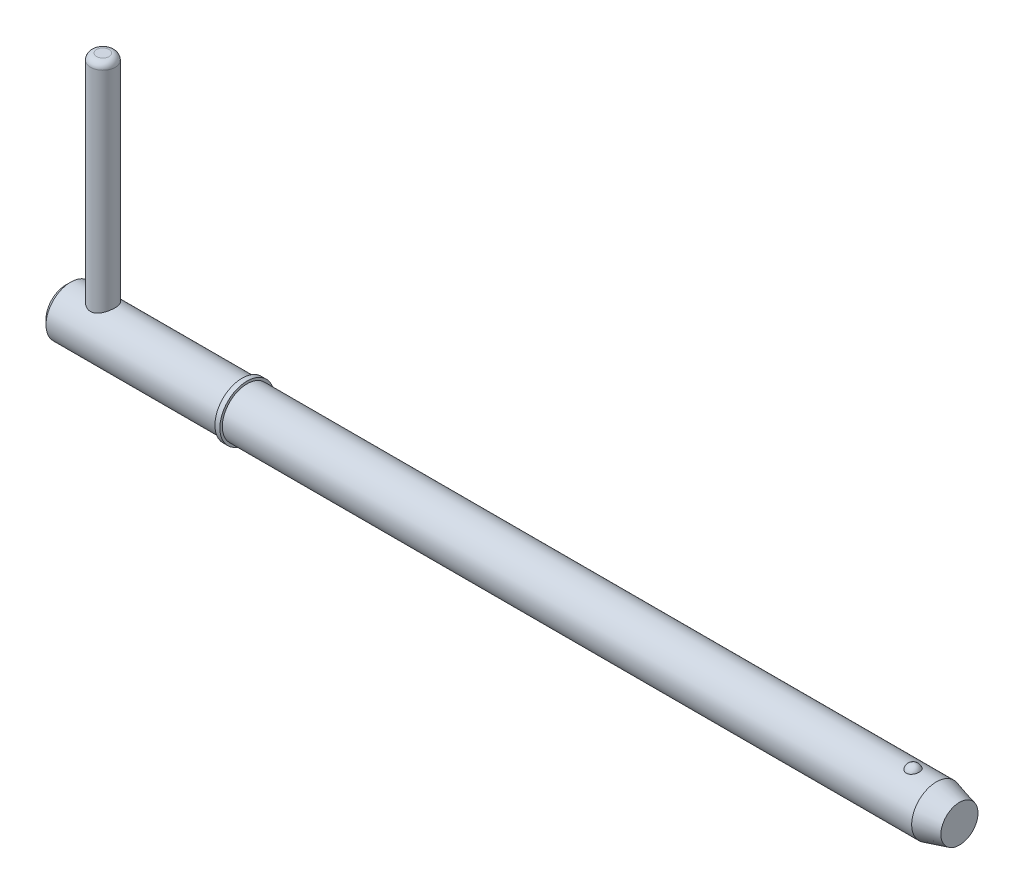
ISO-10303-21;
HEADER;
FILE_DESCRIPTION(('STEP AP214'),'2;1');
FILE_NAME('part.step','',(''),(''),'','','');
FILE_SCHEMA(('AUTOMOTIVE_DESIGN { 1 0 10303 214 1 1 1 1 }'));
ENDSEC;
DATA;
#1=APPLICATION_CONTEXT('core data for automotive mechanical design processes');
#2=APPLICATION_PROTOCOL_DEFINITION('international standard','automotive_design',2000,#1);
#3=PRODUCT_CONTEXT('',#1,'mechanical');
#4=PRODUCT('Part','Part','',(#3));
#5=PRODUCT_RELATED_PRODUCT_CATEGORY('part','',(#4));
#6=PRODUCT_DEFINITION_FORMATION('','',#4);
#7=PRODUCT_DEFINITION_CONTEXT('part definition',#1,'design');
#8=PRODUCT_DEFINITION('design','',#6,#7);
#9=PRODUCT_DEFINITION_SHAPE('','',#8);
#10=(LENGTH_UNIT() NAMED_UNIT(*) SI_UNIT(.MILLI.,.METRE.));
#11=(NAMED_UNIT(*) PLANE_ANGLE_UNIT() SI_UNIT($,.RADIAN.));
#12=(NAMED_UNIT(*) SI_UNIT($,.STERADIAN.) SOLID_ANGLE_UNIT());
#13=UNCERTAINTY_MEASURE_WITH_UNIT(LENGTH_MEASURE(1.E-05),#10,'distance_accuracy_value','');
#14=(GEOMETRIC_REPRESENTATION_CONTEXT(3) GLOBAL_UNCERTAINTY_ASSIGNED_CONTEXT((#13)) GLOBAL_UNIT_ASSIGNED_CONTEXT((#10,
#11,#12)) REPRESENTATION_CONTEXT('',''));
#15=CARTESIAN_POINT('',(0.,0.,0.));
#16=DIRECTION('',(0.,0.,1.));
#17=DIRECTION('',(1.,0.,0.));
#18=AXIS2_PLACEMENT_3D('',#15,#16,#17);
#19=CARTESIAN_POINT('',(3.57,23.02,0.));
#20=DIRECTION('',(0.,-1.,0.));
#21=DIRECTION('',(0.,0.,-1.));
#22=AXIS2_PLACEMENT_3D('',#19,#20,#21);
#23=CYLINDRICAL_SURFACE('',#22,1.19);
#24=CARTESIAN_POINT('',(3.57,-1.785,0.));
#25=DIRECTION('',(0.,1.,0.));
#26=DIRECTION('',(0.,0.,1.));
#27=AXIS2_PLACEMENT_3D('',#24,#25,#26);
#28=CIRCLE('',#27,1.19);
#29=CARTESIAN_POINT('',(3.57,-1.785,1.19));
#30=VERTEX_POINT('',#29);
#31=EDGE_CURVE('P0_E25',#30,#30,#28,.T.);
#32=ORIENTED_EDGE('',*,*,#31,.T.);
#33=EDGE_LOOP('',(#32));
#34=FACE_BOUND('',#33,.T.);
#35=CARTESIAN_POINT('',(3.57,22.425,0.));
#36=DIRECTION('',(0.,1.,0.));
#37=DIRECTION('',(0.,0.,1.));
#38=AXIS2_PLACEMENT_3D('',#35,#36,#37);
#39=CIRCLE('',#38,1.19);
#40=CARTESIAN_POINT('',(3.57,22.425,1.19));
#41=VERTEX_POINT('',#40);
#42=EDGE_CURVE('P0_E29',#41,#41,#39,.F.);
#43=ORIENTED_EDGE('',*,*,#42,.T.);
#44=EDGE_LOOP('',(#43));
#45=FACE_BOUND('',#44,.T.);
#46=ADVANCED_FACE('P0_F14',(#34,#45),#23,.T.);
#47=CARTESIAN_POINT('',(3.57,23.02,0.));
#48=DIRECTION('',(0.,1.,0.));
#49=DIRECTION('',(0.,0.,1.));
#50=AXIS2_PLACEMENT_3D('',#47,#48,#49);
#51=PLANE('',#50);
#52=CARTESIAN_POINT('',(3.57,23.02,0.));
#53=DIRECTION('',(0.,1.,0.));
#54=DIRECTION('',(0.,0.,1.));
#55=AXIS2_PLACEMENT_3D('',#52,#53,#54);
#56=CIRCLE('',#55,0.595);
#57=CARTESIAN_POINT('',(3.57,23.02,0.595));
#58=VERTEX_POINT('',#57);
#59=EDGE_CURVE('P0_E10',#58,#58,#56,.T.);
#60=ORIENTED_EDGE('',*,*,#59,.T.);
#61=EDGE_LOOP('',(#60));
#62=FACE_BOUND('',#61,.T.);
#63=ADVANCED_FACE('P0_F46',(#62),#51,.T.);
#64=CARTESIAN_POINT('',(3.57,-2.38,0.));
#65=DIRECTION('',(0.,1.,0.));
#66=DIRECTION('',(0.,0.,1.));
#67=AXIS2_PLACEMENT_3D('',#64,#65,#66);
#68=PLANE('',#67);
#69=CARTESIAN_POINT('',(3.57,-2.38,0.));
#70=DIRECTION('',(0.,1.,0.));
#71=DIRECTION('',(0.,0.,1.));
#72=AXIS2_PLACEMENT_3D('',#69,#70,#71);
#73=CIRCLE('',#72,0.595);
#74=CARTESIAN_POINT('',(3.57,-2.38,0.595));
#75=VERTEX_POINT('',#74);
#76=EDGE_CURVE('P0_E21',#75,#75,#73,.F.);
#77=ORIENTED_EDGE('',*,*,#76,.T.);
#78=EDGE_LOOP('',(#77));
#79=FACE_BOUND('',#78,.T.);
#80=ADVANCED_FACE('P0_F43',(#79),#68,.F.);
#81=CARTESIAN_POINT('',(3.57,-1.785,0.));
#82=DIRECTION('',(0.,1.,0.));
#83=DIRECTION('',(0.,0.,1.));
#84=AXIS2_PLACEMENT_3D('',#81,#82,#83);
#85=DEGENERATE_TOROIDAL_SURFACE('',#84,0.595,0.595,.T.);
#86=ORIENTED_EDGE('',*,*,#76,.F.);
#87=EDGE_LOOP('',(#86));
#88=FACE_BOUND('',#87,.T.);
#89=ORIENTED_EDGE('',*,*,#31,.F.);
#90=EDGE_LOOP('',(#89));
#91=FACE_BOUND('',#90,.T.);
#92=ADVANCED_FACE('P0_F38',(#88,#91),#85,.T.);
#93=CARTESIAN_POINT('',(3.57,22.425,0.));
#94=DIRECTION('',(0.,1.,0.));
#95=DIRECTION('',(0.,0.,1.));
#96=AXIS2_PLACEMENT_3D('',#93,#94,#95);
#97=DEGENERATE_TOROIDAL_SURFACE('',#96,0.595,0.595,.T.);
#98=ORIENTED_EDGE('',*,*,#42,.F.);
#99=EDGE_LOOP('',(#98));
#100=FACE_BOUND('',#99,.T.);
#101=ORIENTED_EDGE('',*,*,#59,.F.);
#102=EDGE_LOOP('',(#101));
#103=FACE_BOUND('',#102,.T.);
#104=ADVANCED_FACE('P0_F16',(#100,#103),#97,.T.);
#105=CLOSED_SHELL('',(#46,#63,#80,#92,#104));
#106=MANIFOLD_SOLID_BREP('P0_B1',#105);
#107=CARTESIAN_POINT('',(0.,0.,0.));
#108=DIRECTION('',(1.,0.,0.));
#109=DIRECTION('',(0.,0.,-1.));
#110=AXIS2_PLACEMENT_3D('',#107,#108,#109);
#111=CYLINDRICAL_SURFACE('',#110,2.38);
#112=CARTESIAN_POINT('',(83.8094297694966,0.,0.));
#113=DIRECTION('',(1.,0.,0.));
#114=DIRECTION('',(0.,0.,-1.));
#115=AXIS2_PLACEMENT_3D('',#112,#113,#114);
#116=CIRCLE('',#115,2.38);
#117=CARTESIAN_POINT('',(83.8094297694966,0.,-2.38));
#118=VERTEX_POINT('',#117);
#119=EDGE_CURVE('P1_E81',#118,#118,#116,.T.);
#120=ORIENTED_EDGE('',*,*,#119,.F.);
#121=EDGE_LOOP('',(#120));
#122=FACE_BOUND('',#121,.T.);
#123=CARTESIAN_POINT('',(17.45,0.,0.));
#124=DIRECTION('',(1.,0.,0.));
#125=DIRECTION('',(0.,0.,-1.));
#126=AXIS2_PLACEMENT_3D('',#123,#124,#125);
#127=CIRCLE('',#126,2.38);
#128=CARTESIAN_POINT('',(17.45,0.,-2.38));
#129=VERTEX_POINT('',#128);
#130=EDGE_CURVE('P1_E85',#129,#129,#127,.T.);
#131=ORIENTED_EDGE('',*,*,#130,.T.);
#132=EDGE_LOOP('',(#131));
#133=FACE_BOUND('',#132,.T.);
#134=CARTESIAN_POINT('',(81.5634492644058,2.2921568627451,0.640637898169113));
#135=CARTESIAN_POINT('',(81.5303559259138,2.29215737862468,0.64063719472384));
#136=CARTESIAN_POINT('',(81.4972546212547,2.29293179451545,0.637884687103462));
#137=CARTESIAN_POINT('',(81.4320176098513,2.29594030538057,0.626968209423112));
#138=CARTESIAN_POINT('',(81.3998823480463,2.29817506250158,0.618801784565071));
#139=CARTESIAN_POINT('',(81.3375402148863,2.3038430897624,0.597351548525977));
#140=CARTESIAN_POINT('',(81.3073305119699,2.30727454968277,0.584075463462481));
#141=CARTESIAN_POINT('',(81.2495674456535,2.31495941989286,0.552829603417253));
#142=CARTESIAN_POINT('',(81.2220141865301,2.31921286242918,0.534859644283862));
#143=CARTESIAN_POINT('',(81.1695938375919,2.32820213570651,0.494282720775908));
#144=CARTESIAN_POINT('',(81.1448050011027,2.33294694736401,0.471576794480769));
#145=CARTESIAN_POINT('',(81.0992169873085,2.34234144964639,0.422446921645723));
#146=CARTESIAN_POINT('',(81.0784185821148,2.34699112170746,0.396022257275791));
#147=CARTESIAN_POINT('',(81.0403580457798,2.35593942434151,0.33885587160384));
#148=CARTESIAN_POINT('',(81.0233051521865,2.36021170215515,0.307970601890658));
#149=CARTESIAN_POINT('',(80.9943607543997,2.3677057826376,0.243750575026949));
#150=CARTESIAN_POINT('',(80.9824701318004,2.37092740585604,0.210415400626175));
#151=CARTESIAN_POINT('',(80.9638076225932,2.37606901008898,0.141189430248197));
#152=CARTESIAN_POINT('',(80.9571956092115,2.37794816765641,0.105252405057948));
#153=CARTESIAN_POINT('',(80.9498095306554,2.38005135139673,0.0327351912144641));
#154=CARTESIAN_POINT('',(80.9490358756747,2.38027526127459,-0.00384504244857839));
#155=CARTESIAN_POINT('',(80.9533628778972,2.37903842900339,-0.0769838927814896));
#156=CARTESIAN_POINT('',(80.9585202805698,2.37756141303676,-0.113538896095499));
#157=CARTESIAN_POINT('',(80.9747013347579,2.37305303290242,-0.185229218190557));
#158=CARTESIAN_POINT('',(80.9857251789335,2.37002161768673,-0.220364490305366));
#159=CARTESIAN_POINT('',(81.0133977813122,2.36273722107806,-0.288156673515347));
#160=CARTESIAN_POINT('',(81.0300389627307,2.35848588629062,-0.320816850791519));
#161=CARTESIAN_POINT('',(81.0685984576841,2.34923130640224,-0.382744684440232));
#162=CARTESIAN_POINT('',(81.090516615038,2.34422808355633,-0.412012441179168));
#163=CARTESIAN_POINT('',(81.1387549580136,2.33412555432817,-0.465830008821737));
#164=CARTESIAN_POINT('',(81.1650028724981,2.32902887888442,-0.490444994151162));
#165=CARTESIAN_POINT('',(81.2214769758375,2.31926941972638,-0.534700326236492));
#166=CARTESIAN_POINT('',(81.251702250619,2.3146065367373,-0.554341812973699));
#167=CARTESIAN_POINT('',(81.3140618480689,2.30645675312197,-0.587312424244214));
#168=CARTESIAN_POINT('',(81.3460780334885,2.30293152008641,-0.600855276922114));
#169=CARTESIAN_POINT('',(81.4120795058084,2.29725171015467,-0.622220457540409));
#170=CARTESIAN_POINT('',(81.4460641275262,2.29509667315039,-0.630044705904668));
#171=CARTESIAN_POINT('',(81.513299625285,2.29249264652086,-0.639452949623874));
#172=CARTESIAN_POINT('',(81.5465087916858,2.29196755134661,-0.641315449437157));
#173=CARTESIAN_POINT('',(81.612763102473,2.29246849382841,-0.639522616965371));
#174=CARTESIAN_POINT('',(81.6458082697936,2.29349430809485,-0.635868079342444));
#175=CARTESIAN_POINT('',(81.7101025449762,2.29694059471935,-0.623301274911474));
#176=CARTESIAN_POINT('',(81.7413744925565,2.29933234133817,-0.614497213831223));
#177=CARTESIAN_POINT('',(81.8019952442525,2.30522511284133,-0.592006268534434));
#178=CARTESIAN_POINT('',(81.8313438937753,2.30872622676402,-0.578318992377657));
#179=CARTESIAN_POINT('',(81.8880369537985,2.31655795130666,-0.546112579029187));
#180=CARTESIAN_POINT('',(81.915320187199,2.32090569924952,-0.527490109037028));
#181=CARTESIAN_POINT('',(81.9664904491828,2.3299220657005,-0.486117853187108));
#182=CARTESIAN_POINT('',(81.9903767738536,2.33459075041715,-0.463367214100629));
#183=CARTESIAN_POINT('',(82.0352722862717,2.34399834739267,-0.413220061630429));
#184=CARTESIAN_POINT('',(82.0560972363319,2.34873051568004,-0.38565730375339));
#185=CARTESIAN_POINT('',(82.093056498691,2.35754932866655,-0.327455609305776));
#186=CARTESIAN_POINT('',(82.1091898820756,2.36163584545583,-0.296816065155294));
#187=CARTESIAN_POINT('',(82.1369822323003,2.36889321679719,-0.232047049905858));
#188=CARTESIAN_POINT('',(82.1484450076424,2.37202275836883,-0.19782862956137));
#189=CARTESIAN_POINT('',(82.1657523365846,2.37681926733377,-0.127900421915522));
#190=CARTESIAN_POINT('',(82.1715962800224,2.37848607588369,-0.0921904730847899));
#191=CARTESIAN_POINT('',(82.177605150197,2.38020024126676,-0.0196348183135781));
#192=CARTESIAN_POINT('',(82.1776704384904,2.38021918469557,0.0172198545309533));
#193=CARTESIAN_POINT('',(82.1718689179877,2.37856356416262,0.0904219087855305));
#194=CARTESIAN_POINT('',(82.1660018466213,2.37688892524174,0.126769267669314));
#195=CARTESIAN_POINT('',(82.148425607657,2.37201688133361,0.198028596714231));
#196=CARTESIAN_POINT('',(82.1366998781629,2.36881516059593,0.232936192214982));
#197=CARTESIAN_POINT('',(82.1076354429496,2.36123444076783,0.30019678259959));
#198=CARTESIAN_POINT('',(82.0902967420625,2.3568554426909,0.332549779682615));
#199=CARTESIAN_POINT('',(82.0505350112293,2.34744667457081,0.393495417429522));
#200=CARTESIAN_POINT('',(82.0281528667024,2.34242227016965,0.422115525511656));
#201=CARTESIAN_POINT('',(81.9787391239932,2.33227293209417,0.475004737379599));
#202=CARTESIAN_POINT('',(81.9517076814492,2.32714800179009,0.49927398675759));
#203=CARTESIAN_POINT('',(81.8944988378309,2.31755359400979,0.542046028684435));
#204=CARTESIAN_POINT('',(81.8644297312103,2.3130698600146,0.560690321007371));
#205=CARTESIAN_POINT('',(81.8013869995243,2.30514125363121,0.592447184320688));
#206=CARTESIAN_POINT('',(81.7684158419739,2.30169550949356,0.605564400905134));
#207=CARTESIAN_POINT('',(81.7068424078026,2.29677744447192,0.623927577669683));
#208=CARTESIAN_POINT('',(81.6785555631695,2.295058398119,0.630178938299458));
#209=CARTESIAN_POINT('',(81.6213308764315,2.29274795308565,0.638534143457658));
#210=CARTESIAN_POINT('',(81.5923931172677,2.29215641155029,0.640638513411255));
#211=CARTESIAN_POINT('',(81.5634492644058,2.2921568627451,0.640637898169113));
#212=B_SPLINE_CURVE_WITH_KNOTS('',3,(#134,#135,#136,#137,#138,#139,#140,#141,#142,#143,#144,
#145,#146,#147,#148,#149,#150,#151,#152,#153,#154,#155,#156,#157,#158,#159,#160,#161,#162,#163,
#164,#165,#166,#167,#168,#169,#170,#171,#172,#173,#174,#175,#176,#177,#178,#179,#180,#181,#182,
#183,#184,#185,#186,#187,#188,#189,#190,#191,#192,#193,#194,#195,#196,#197,#198,#199,#200,#201,
#202,#203,#204,#205,#206,#207,#208,#209,#210,#211),.UNSPECIFIED.,.T.,.F.,(4,2,2,2,2,2,2,2,2,2,2,
2,2,2,2,2,2,2,2,2,2,2,2,2,2,2,2,2,2,2,2,2,2,2,2,2,2,2,4),(0.,0.0991724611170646,
0.198389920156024,0.297457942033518,0.396529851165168,0.497927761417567,0.599345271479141,
0.70547553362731,0.811623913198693,0.920876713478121,1.03013718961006,1.14045177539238,
1.25076998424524,1.36093998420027,1.47110672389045,1.57959248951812,1.68805336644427,
1.79234266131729,1.89659691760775,1.99590391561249,2.09519661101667,2.19247425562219,
2.2897597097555,2.38926978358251,2.48880044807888,2.59293588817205,2.69709193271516,
2.80525821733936,2.91343624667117,3.0234791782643,3.13352698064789,3.24388765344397,
3.35424823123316,3.46374443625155,3.5732369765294,3.67968690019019,3.78604717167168,
3.87279565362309,3.9595331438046),.UNSPECIFIED.);
#213=CARTESIAN_POINT('',(81.5634492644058,2.2921568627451,0.640637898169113));
#214=VERTEX_POINT('',#213);
#215=EDGE_CURVE('P1_E35',#214,#214,#212,.T.);
#216=ORIENTED_EDGE('',*,*,#215,.T.);
#217=EDGE_LOOP('',(#216));
#218=FACE_BOUND('',#217,.T.);
#219=ADVANCED_FACE('P1_F13',(#122,#133,#218),#111,.T.);
#220=CARTESIAN_POINT('',(0.,0.,0.));
#221=DIRECTION('',(-1.,0.,0.));
#222=DIRECTION('',(0.,0.,1.));
#223=AXIS2_PLACEMENT_3D('',#220,#221,#222);
#224=PLANE('',#223);
#225=CARTESIAN_POINT('',(0.,0.,0.));
#226=DIRECTION('',(1.,0.,0.));
#227=DIRECTION('',(0.,0.,-1.));
#228=AXIS2_PLACEMENT_3D('',#225,#226,#227);
#229=CIRCLE('',#228,1.904);
#230=CARTESIAN_POINT('',(0.,0.,-1.904));
#231=VERTEX_POINT('',#230);
#232=EDGE_CURVE('P1_E9',#231,#231,#229,.T.);
#233=ORIENTED_EDGE('',*,*,#232,.F.);
#234=EDGE_LOOP('',(#233));
#235=FACE_BOUND('',#234,.T.);
#236=ADVANCED_FACE('P1_F15',(#235),#224,.T.);
#237=CARTESIAN_POINT('',(0.475999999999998,0.,0.));
#238=DIRECTION('',(1.,0.,0.));
#239=DIRECTION('',(0.,0.,-1.));
#240=AXIS2_PLACEMENT_3D('',#237,#238,#239);
#241=CONICAL_SURFACE('',#240,2.38,0.78539816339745);
#242=ORIENTED_EDGE('',*,*,#232,.T.);
#243=EDGE_LOOP('',(#242));
#244=FACE_BOUND('',#243,.T.);
#245=CARTESIAN_POINT('',(0.475999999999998,0.,0.));
#246=DIRECTION('',(1.,0.,0.));
#247=DIRECTION('',(0.,0.,-1.));
#248=AXIS2_PLACEMENT_3D('',#245,#246,#247);
#249=CIRCLE('',#248,2.38);
#250=CARTESIAN_POINT('',(0.475999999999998,0.,-2.38));
#251=VERTEX_POINT('',#250);
#252=EDGE_CURVE('P1_E26',#251,#251,#249,.T.);
#253=ORIENTED_EDGE('',*,*,#252,.F.);
#254=EDGE_LOOP('',(#253));
#255=FACE_BOUND('',#254,.T.);
#256=ADVANCED_FACE('P1_F77',(#244,#255),#241,.T.);
#257=CARTESIAN_POINT('',(0.,0.,0.));
#258=DIRECTION('',(1.,0.,0.));
#259=DIRECTION('',(0.,0.,-1.));
#260=AXIS2_PLACEMENT_3D('',#257,#258,#259);
#261=CYLINDRICAL_SURFACE('',#260,2.38);
#262=CARTESIAN_POINT('',(3.57,-2.06114046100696,1.19));
#263=CARTESIAN_POINT('',(3.50799170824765,-2.06114586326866,1.18999567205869));
#264=CARTESIAN_POINT('',(3.4459051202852,-2.0639812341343,1.18512096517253));
#265=CARTESIAN_POINT('',(3.32363755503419,-2.07491216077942,1.16587061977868));
#266=CARTESIAN_POINT('',(3.26346086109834,-2.08301876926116,1.15147501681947));
#267=CARTESIAN_POINT('',(3.14701251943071,-2.10331722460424,1.11395893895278));
#268=CARTESIAN_POINT('',(3.09072196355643,-2.1154873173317,1.09088484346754));
#269=CARTESIAN_POINT('',(2.9828251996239,-2.14250771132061,1.03680835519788));
#270=CARTESIAN_POINT('',(2.93121924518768,-2.15735815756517,1.00580553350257));
#271=CARTESIAN_POINT('',(2.82945618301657,-2.18956274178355,0.933753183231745));
#272=CARTESIAN_POINT('',(2.77976962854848,-2.20702235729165,0.892085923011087));
#273=CARTESIAN_POINT('',(2.68772401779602,-2.2416265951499,0.801172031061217));
#274=CARTESIAN_POINT('',(2.64536861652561,-2.25877105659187,0.751921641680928));
#275=CARTESIAN_POINT('',(2.56639309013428,-2.29219557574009,0.64318258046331));
#276=CARTESIAN_POINT('',(2.53035201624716,-2.30833946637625,0.583227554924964));
#277=CARTESIAN_POINT('',(2.46908238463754,-2.3365739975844,0.45714686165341));
#278=CARTESIAN_POINT('',(2.44384700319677,-2.34866719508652,0.391025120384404));
#279=CARTESIAN_POINT('',(2.40676945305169,-2.36667748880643,0.259473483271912));
#280=CARTESIAN_POINT('',(2.39410206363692,-2.37297281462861,0.194329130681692));
#281=CARTESIAN_POINT('',(2.3798023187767,-2.3800902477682,0.0625590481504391));
#282=CARTESIAN_POINT('',(2.37816328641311,-2.38091566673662,-0.00406576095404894));
#283=CARTESIAN_POINT('',(2.38564854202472,-2.37717948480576,-0.130700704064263));
#284=CARTESIAN_POINT('',(2.39384923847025,-2.37308010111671,-0.190782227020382));
#285=CARTESIAN_POINT('',(2.41912820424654,-2.360653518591,-0.308583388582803));
#286=CARTESIAN_POINT('',(2.43620713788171,-2.35232600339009,-0.366302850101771));
#287=CARTESIAN_POINT('',(2.47886825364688,-2.33206184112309,-0.478748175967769));
#288=CARTESIAN_POINT('',(2.50456481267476,-2.32007685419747,-0.533421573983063));
#289=CARTESIAN_POINT('',(2.56357346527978,-2.29357798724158,-0.637812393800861));
#290=CARTESIAN_POINT('',(2.5968882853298,-2.27906320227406,-0.687528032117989));
#291=CARTESIAN_POINT('',(2.67380546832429,-2.24724829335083,-0.785606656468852));
#292=CARTESIAN_POINT('',(2.71808260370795,-2.22981457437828,-0.833397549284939));
#293=CARTESIAN_POINT('',(2.81386177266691,-2.19500665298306,-0.921184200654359));
#294=CARTESIAN_POINT('',(2.86536931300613,-2.17763250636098,-0.961173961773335));
#295=CARTESIAN_POINT('',(2.97815134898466,-2.14371545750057,-1.03471134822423));
#296=CARTESIAN_POINT('',(3.03983836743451,-2.12729540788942,-1.06768860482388));
#297=CARTESIAN_POINT('',(3.16889582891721,-2.09886785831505,-1.12254974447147));
#298=CARTESIAN_POINT('',(3.2362602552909,-2.0868557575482,-1.14444520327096));
#299=CARTESIAN_POINT('',(3.36914526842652,-2.06994116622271,-1.1747444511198));
#300=CARTESIAN_POINT('',(3.43438893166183,-2.06455070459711,-1.18407989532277));
#301=CARTESIAN_POINT('',(3.56571759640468,-2.06010324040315,-1.1918051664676));
#302=CARTESIAN_POINT('',(3.63180197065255,-2.06104176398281,-1.19020272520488));
#303=CARTESIAN_POINT('',(3.75522816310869,-2.06862860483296,-1.17695289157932));
#304=CARTESIAN_POINT('',(3.81273554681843,-2.07464109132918,-1.16642350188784));
#305=CARTESIAN_POINT('',(3.92505766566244,-2.09075885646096,-1.1372785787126));
#306=CARTESIAN_POINT('',(3.97987152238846,-2.1008654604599,-1.1186604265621));
#307=CARTESIAN_POINT('',(4.08813948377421,-2.12458104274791,-1.07296063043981));
#308=CARTESIAN_POINT('',(4.14141303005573,-2.13833055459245,-1.04552693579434));
#309=CARTESIAN_POINT('',(4.2429084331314,-2.16765782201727,-0.983281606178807));
#310=CARTESIAN_POINT('',(4.29112767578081,-2.18323651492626,-0.948466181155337));
#311=CARTESIAN_POINT('',(4.38750473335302,-2.2168271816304,-0.867316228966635));
#312=CARTESIAN_POINT('',(4.43488860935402,-2.23489833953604,-0.82008287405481));
#313=CARTESIAN_POINT('',(4.52130056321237,-2.26973739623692,-0.718051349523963));
#314=CARTESIAN_POINT('',(4.56032581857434,-2.28650485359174,-0.663250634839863));
#315=CARTESIAN_POINT('',(4.62978273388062,-2.31742220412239,-0.545657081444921));
#316=CARTESIAN_POINT('',(4.65996041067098,-2.33149133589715,-0.482691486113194));
#317=CARTESIAN_POINT('',(4.7089941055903,-2.35481192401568,-0.351671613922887));
#318=CARTESIAN_POINT('',(4.7278600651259,-2.36406760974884,-0.283621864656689));
#319=CARTESIAN_POINT('',(4.75210859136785,-2.3760433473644,-0.151105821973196));
#320=CARTESIAN_POINT('',(4.75856947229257,-2.37928514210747,-0.0868836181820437));
#321=CARTESIAN_POINT('',(4.76100348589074,-2.38050135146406,0.0417999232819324));
#322=CARTESIAN_POINT('',(4.75698028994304,-2.37847760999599,0.106261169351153));
#323=CARTESIAN_POINT('',(4.73927447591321,-2.36969422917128,0.229120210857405));
#324=CARTESIAN_POINT('',(4.72624582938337,-2.36325544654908,0.287637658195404));
#325=CARTESIAN_POINT('',(4.69178087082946,-2.34658591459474,0.401560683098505));
#326=CARTESIAN_POINT('',(4.67034335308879,-2.33635462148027,0.456965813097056));
#327=CARTESIAN_POINT('',(4.61871480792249,-2.31247857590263,0.565753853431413));
#328=CARTESIAN_POINT('',(4.58818860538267,-2.29870654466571,0.618948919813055));
#329=CARTESIAN_POINT('',(4.51967006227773,-2.26918878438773,0.719681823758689));
#330=CARTESIAN_POINT('',(4.48167429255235,-2.25344215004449,0.76721704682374));
#331=CARTESIAN_POINT('',(4.39491140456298,-2.21969046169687,0.860267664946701));
#332=CARTESIAN_POINT('',(4.34544863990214,-2.20161660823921,0.905111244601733));
#333=CARTESIAN_POINT('',(4.23943364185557,-2.16655060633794,0.986109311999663));
#334=CARTESIAN_POINT('',(4.18287520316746,-2.1495594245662,1.02225611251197));
#335=CARTESIAN_POINT('',(4.06190239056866,-2.1181953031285,1.08579298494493));
#336=CARTESIAN_POINT('',(3.9972962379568,-2.10392207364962,1.11287022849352));
#337=CARTESIAN_POINT('',(3.86353443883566,-2.08090726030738,1.15534566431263));
#338=CARTESIAN_POINT('',(3.7943948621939,-2.07214719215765,1.17078291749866));
#339=CARTESIAN_POINT('',(3.69875162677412,-2.06499834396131,1.18329673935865));
#340=CARTESIAN_POINT('',(3.67309220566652,-2.06355673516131,1.18580656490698));
#341=CARTESIAN_POINT('',(3.62162638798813,-2.06162663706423,1.18915915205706));
#342=CARTESIAN_POINT('',(3.59581998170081,-2.0611382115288,1.19000180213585));
#343=CARTESIAN_POINT('',(3.57,-2.06114046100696,1.19));
#344=B_SPLINE_CURVE_WITH_KNOTS('',3,(#262,#263,#264,#265,#266,#267,#268,#269,#270,#271,#272,
#273,#274,#275,#276,#277,#278,#279,#280,#281,#282,#283,#284,#285,#286,#287,#288,#289,#290,#291,
#292,#293,#294,#295,#296,#297,#298,#299,#300,#301,#302,#303,#304,#305,#306,#307,#308,#309,#310,
#311,#312,#313,#314,#315,#316,#317,#318,#319,#320,#321,#322,#323,#324,#325,#326,#327,#328,#329,
#330,#331,#332,#333,#334,#335,#336,#337,#338,#339,#340,#341,#342,#343),.UNSPECIFIED.,.T.,.F.,(4,
2,2,2,2,2,2,2,2,2,2,2,2,2,2,2,2,2,2,2,2,2,2,2,2,2,2,2,2,2,2,2,2,2,2,2,2,2,2,2,4),(0.,
0.185916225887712,0.372223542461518,0.557549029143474,0.742884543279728,0.943506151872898,
1.14422749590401,1.35847891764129,1.5725948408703,1.77147547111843,1.97023568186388,
2.15171156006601,2.33320101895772,2.51720146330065,2.70126786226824,2.902733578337,
3.10435357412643,3.31877721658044,3.53297641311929,3.73020126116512,3.92728670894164,
4.1028127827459,4.27839572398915,4.46211082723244,4.64592048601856,4.8529002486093,
5.0599497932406,5.27246375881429,5.48479067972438,5.67763601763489,5.87041383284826,
6.05048865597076,6.23058930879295,6.41839293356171,6.60628297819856,6.8128718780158,
7.01964271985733,7.2329479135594,7.44553408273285,7.52294360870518,7.60035831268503),.UNSPECIFIED.);
#345=CARTESIAN_POINT('',(3.57,-2.06114046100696,1.19));
#346=VERTEX_POINT('',#345);
#347=EDGE_CURVE('P1_E17',#346,#346,#344,.T.);
#348=ORIENTED_EDGE('',*,*,#347,.F.);
#349=EDGE_LOOP('',(#348));
#350=FACE_BOUND('',#349,.T.);
#351=CARTESIAN_POINT('',(3.57,2.06114046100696,1.19));
#352=CARTESIAN_POINT('',(3.63200829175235,2.06114586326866,1.18999567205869));
#353=CARTESIAN_POINT('',(3.6940948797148,2.0639812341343,1.18512096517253));
#354=CARTESIAN_POINT('',(3.81636244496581,2.07491216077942,1.16587061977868));
#355=CARTESIAN_POINT('',(3.87653913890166,2.08301876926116,1.15147501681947));
#356=CARTESIAN_POINT('',(3.99298748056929,2.10331722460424,1.11395893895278));
#357=CARTESIAN_POINT('',(4.04927803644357,2.1154873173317,1.09088484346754));
#358=CARTESIAN_POINT('',(4.1571748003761,2.14250771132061,1.03680835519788));
#359=CARTESIAN_POINT('',(4.20878075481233,2.15735815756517,1.00580553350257));
#360=CARTESIAN_POINT('',(4.31054381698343,2.18956274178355,0.933753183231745));
#361=CARTESIAN_POINT('',(4.36023037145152,2.20702235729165,0.892085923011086));
#362=CARTESIAN_POINT('',(4.45227598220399,2.2416265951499,0.801172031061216));
#363=CARTESIAN_POINT('',(4.49463138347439,2.25877105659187,0.751921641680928));
#364=CARTESIAN_POINT('',(4.57360690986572,2.29219557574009,0.643182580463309));
#365=CARTESIAN_POINT('',(4.60964798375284,2.30833946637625,0.583227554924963));
#366=CARTESIAN_POINT('',(4.67091761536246,2.3365739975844,0.457146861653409));
#367=CARTESIAN_POINT('',(4.69615299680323,2.34866719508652,0.391025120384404));
#368=CARTESIAN_POINT('',(4.73323054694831,2.36667748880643,0.259473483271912));
#369=CARTESIAN_POINT('',(4.74589793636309,2.37297281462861,0.194329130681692));
#370=CARTESIAN_POINT('',(4.7601976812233,2.3800902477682,0.0625590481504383));
#371=CARTESIAN_POINT('',(4.76183671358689,2.38091566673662,-0.00406576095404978));
#372=CARTESIAN_POINT('',(4.75435145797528,2.37717948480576,-0.130700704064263));
#373=CARTESIAN_POINT('',(4.74615076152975,2.37308010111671,-0.190782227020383));
#374=CARTESIAN_POINT('',(4.72087179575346,2.360653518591,-0.308583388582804));
#375=CARTESIAN_POINT('',(4.70379286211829,2.35232600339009,-0.366302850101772));
#376=CARTESIAN_POINT('',(4.66113174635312,2.33206184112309,-0.478748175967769));
#377=CARTESIAN_POINT('',(4.63543518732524,2.32007685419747,-0.533421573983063));
#378=CARTESIAN_POINT('',(4.57642653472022,2.29357798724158,-0.637812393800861));
#379=CARTESIAN_POINT('',(4.5431117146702,2.27906320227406,-0.687528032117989));
#380=CARTESIAN_POINT('',(4.46619453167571,2.24724829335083,-0.785606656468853));
#381=CARTESIAN_POINT('',(4.42191739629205,2.22981457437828,-0.83339754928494));
#382=CARTESIAN_POINT('',(4.32613822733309,2.19500665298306,-0.921184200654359));
#383=CARTESIAN_POINT('',(4.27463068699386,2.17763250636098,-0.961173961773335));
#384=CARTESIAN_POINT('',(4.16184865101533,2.14371545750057,-1.03471134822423));
#385=CARTESIAN_POINT('',(4.10016163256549,2.12729540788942,-1.06768860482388));
#386=CARTESIAN_POINT('',(3.97110417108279,2.09886785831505,-1.12254974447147));
#387=CARTESIAN_POINT('',(3.9037397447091,2.0868557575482,-1.14444520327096));
#388=CARTESIAN_POINT('',(3.77085473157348,2.06994116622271,-1.1747444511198));
#389=CARTESIAN_POINT('',(3.70561106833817,2.06455070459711,-1.18407989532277));
#390=CARTESIAN_POINT('',(3.57428240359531,2.06010324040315,-1.1918051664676));
#391=CARTESIAN_POINT('',(3.50819802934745,2.06104176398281,-1.19020272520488));
#392=CARTESIAN_POINT('',(3.38477183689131,2.06862860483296,-1.17695289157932));
#393=CARTESIAN_POINT('',(3.32726445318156,2.07464109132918,-1.16642350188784));
#394=CARTESIAN_POINT('',(3.21494233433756,2.09075885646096,-1.1372785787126));
#395=CARTESIAN_POINT('',(3.16012847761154,2.1008654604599,-1.1186604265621));
#396=CARTESIAN_POINT('',(3.05186051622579,2.12458104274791,-1.07296063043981));
#397=CARTESIAN_POINT('',(2.99858696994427,2.13833055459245,-1.04552693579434));
#398=CARTESIAN_POINT('',(2.8970915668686,2.16765782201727,-0.983281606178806));
#399=CARTESIAN_POINT('',(2.84887232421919,2.18323651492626,-0.948466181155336));
#400=CARTESIAN_POINT('',(2.75249526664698,2.2168271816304,-0.867316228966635));
#401=CARTESIAN_POINT('',(2.70511139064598,2.23489833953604,-0.820082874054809));
#402=CARTESIAN_POINT('',(2.61869943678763,2.26973739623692,-0.718051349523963));
#403=CARTESIAN_POINT('',(2.57967418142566,2.28650485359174,-0.663250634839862));
#404=CARTESIAN_POINT('',(2.51021726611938,2.31742220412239,-0.54565708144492));
#405=CARTESIAN_POINT('',(2.48003958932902,2.33149133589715,-0.482691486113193));
#406=CARTESIAN_POINT('',(2.4310058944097,2.35481192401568,-0.351671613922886));
#407=CARTESIAN_POINT('',(2.4121399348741,2.36406760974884,-0.283621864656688));
#408=CARTESIAN_POINT('',(2.38789140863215,2.3760433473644,-0.151105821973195));
#409=CARTESIAN_POINT('',(2.38143052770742,2.37928514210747,-0.0868836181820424));
#410=CARTESIAN_POINT('',(2.37899651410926,2.38050135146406,0.0417999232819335));
#411=CARTESIAN_POINT('',(2.38301971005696,2.37847760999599,0.106261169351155));
#412=CARTESIAN_POINT('',(2.40072552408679,2.36969422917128,0.229120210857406));
#413=CARTESIAN_POINT('',(2.41375417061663,2.36325544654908,0.287637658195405));
#414=CARTESIAN_POINT('',(2.44821912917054,2.34658591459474,0.401560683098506));
#415=CARTESIAN_POINT('',(2.46965664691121,2.33635462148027,0.456965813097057));
#416=CARTESIAN_POINT('',(2.52128519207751,2.31247857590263,0.565753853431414));
#417=CARTESIAN_POINT('',(2.55181139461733,2.29870654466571,0.618948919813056));
#418=CARTESIAN_POINT('',(2.62032993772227,2.26918878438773,0.719681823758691));
#419=CARTESIAN_POINT('',(2.65832570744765,2.25344215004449,0.767217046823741));
#420=CARTESIAN_POINT('',(2.74508859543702,2.21969046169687,0.860267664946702));
#421=CARTESIAN_POINT('',(2.79455136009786,2.20161660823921,0.905111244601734));
#422=CARTESIAN_POINT('',(2.90056635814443,2.16655060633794,0.986109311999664));
#423=CARTESIAN_POINT('',(2.95712479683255,2.1495594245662,1.02225611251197));
#424=CARTESIAN_POINT('',(3.07809760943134,2.1181953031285,1.08579298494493));
#425=CARTESIAN_POINT('',(3.1427037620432,2.10392207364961,1.11287022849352));
#426=CARTESIAN_POINT('',(3.27646556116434,2.08090726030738,1.15534566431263));
#427=CARTESIAN_POINT('',(3.3456051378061,2.07214719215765,1.17078291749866));
#428=CARTESIAN_POINT('',(3.44124837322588,2.06499834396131,1.18329673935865));
#429=CARTESIAN_POINT('',(3.46690779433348,2.06355673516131,1.18580656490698));
#430=CARTESIAN_POINT('',(3.51837361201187,2.06162663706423,1.18915915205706));
#431=CARTESIAN_POINT('',(3.54418001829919,2.0611382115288,1.19000180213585));
#432=CARTESIAN_POINT('',(3.57,2.06114046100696,1.19));
#433=B_SPLINE_CURVE_WITH_KNOTS('',3,(#351,#352,#353,#354,#355,#356,#357,#358,#359,#360,#361,
#362,#363,#364,#365,#366,#367,#368,#369,#370,#371,#372,#373,#374,#375,#376,#377,#378,#379,#380,
#381,#382,#383,#384,#385,#386,#387,#388,#389,#390,#391,#392,#393,#394,#395,#396,#397,#398,#399,
#400,#401,#402,#403,#404,#405,#406,#407,#408,#409,#410,#411,#412,#413,#414,#415,#416,#417,#418,
#419,#420,#421,#422,#423,#424,#425,#426,#427,#428,#429,#430,#431,#432),.UNSPECIFIED.,.T.,.F.,(4,
2,2,2,2,2,2,2,2,2,2,2,2,2,2,2,2,2,2,2,2,2,2,2,2,2,2,2,2,2,2,2,2,2,2,2,2,2,2,2,4),(0.,
0.185916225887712,0.372223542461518,0.557549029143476,0.74288454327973,0.9435061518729,
1.14422749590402,1.35847891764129,1.5725948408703,1.77147547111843,1.97023568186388,
2.15171156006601,2.33320101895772,2.51720146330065,2.70126786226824,2.902733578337,
3.10435357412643,3.31877721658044,3.53297641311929,3.73020126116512,3.92728670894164,
4.1028127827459,4.27839572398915,4.46211082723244,4.64592048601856,4.8529002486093,
5.05994979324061,5.27246375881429,5.48479067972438,5.67763601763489,5.87041383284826,
6.05048865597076,6.23058930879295,6.41839293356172,6.60628297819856,6.8128718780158,
7.01964271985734,7.2329479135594,7.44553408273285,7.52294360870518,7.60035831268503),.UNSPECIFIED.);
#434=CARTESIAN_POINT('',(3.57,2.06114046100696,1.19));
#435=VERTEX_POINT('',#434);
#436=EDGE_CURVE('P1_E43',#435,#435,#433,.T.);
#437=ORIENTED_EDGE('',*,*,#436,.F.);
#438=EDGE_LOOP('',(#437));
#439=FACE_BOUND('',#438,.T.);
#440=ORIENTED_EDGE('',*,*,#252,.T.);
#441=EDGE_LOOP('',(#440));
#442=FACE_BOUND('',#441,.T.);
#443=CARTESIAN_POINT('',(16.974,0.,0.));
#444=DIRECTION('',(1.,0.,0.));
#445=DIRECTION('',(0.,0.,-1.));
#446=AXIS2_PLACEMENT_3D('',#443,#444,#445);
#447=CIRCLE('',#446,2.38);
#448=CARTESIAN_POINT('',(16.974,0.,-2.38));
#449=VERTEX_POINT('',#448);
#450=EDGE_CURVE('P1_E31',#449,#449,#447,.T.);
#451=ORIENTED_EDGE('',*,*,#450,.F.);
#452=EDGE_LOOP('',(#451));
#453=FACE_BOUND('',#452,.T.);
#454=ADVANCED_FACE('P1_F103',(#350,#439,#442,#453),#261,.T.);
#455=CARTESIAN_POINT('',(16.974,2.38,0.));
#456=DIRECTION('',(-1.,0.,0.));
#457=DIRECTION('',(0.,0.,1.));
#458=AXIS2_PLACEMENT_3D('',#455,#456,#457);
#459=PLANE('',#458);
#460=ORIENTED_EDGE('',*,*,#450,.T.);
#461=EDGE_LOOP('',(#460));
#462=FACE_BOUND('',#461,.T.);
#463=CARTESIAN_POINT('',(16.974,0.,0.));
#464=DIRECTION('',(1.,0.,0.));
#465=DIRECTION('',(0.,0.,-1.));
#466=AXIS2_PLACEMENT_3D('',#463,#464,#465);
#467=CIRCLE('',#466,2.618);
#468=CARTESIAN_POINT('',(16.974,0.,-2.618));
#469=VERTEX_POINT('',#468);
#470=EDGE_CURVE('P1_E91',#469,#469,#467,.T.);
#471=ORIENTED_EDGE('',*,*,#470,.F.);
#472=EDGE_LOOP('',(#471));
#473=FACE_BOUND('',#472,.T.);
#474=ADVANCED_FACE('P1_F100',(#462,#473),#459,.T.);
#475=CARTESIAN_POINT('',(0.,0.,0.));
#476=DIRECTION('',(1.,0.,0.));
#477=DIRECTION('',(0.,0.,-1.));
#478=AXIS2_PLACEMENT_3D('',#475,#476,#477);
#479=CYLINDRICAL_SURFACE('',#478,2.618);
#480=ORIENTED_EDGE('',*,*,#470,.T.);
#481=EDGE_LOOP('',(#480));
#482=FACE_BOUND('',#481,.T.);
#483=CARTESIAN_POINT('',(17.45,0.,0.));
#484=DIRECTION('',(1.,0.,0.));
#485=DIRECTION('',(0.,0.,-1.));
#486=AXIS2_PLACEMENT_3D('',#483,#484,#485);
#487=CIRCLE('',#486,2.618);
#488=CARTESIAN_POINT('',(17.45,0.,-2.618));
#489=VERTEX_POINT('',#488);
#490=EDGE_CURVE('P1_E88',#489,#489,#487,.T.);
#491=ORIENTED_EDGE('',*,*,#490,.F.);
#492=EDGE_LOOP('',(#491));
#493=FACE_BOUND('',#492,.T.);
#494=ADVANCED_FACE('P1_F68',(#482,#493),#479,.T.);
#495=CARTESIAN_POINT('',(17.45,2.618,0.));
#496=DIRECTION('',(1.,0.,0.));
#497=DIRECTION('',(0.,0.,-1.));
#498=AXIS2_PLACEMENT_3D('',#495,#496,#497);
#499=PLANE('',#498);
#500=ORIENTED_EDGE('',*,*,#490,.T.);
#501=EDGE_LOOP('',(#500));
#502=FACE_BOUND('',#501,.T.);
#503=ORIENTED_EDGE('',*,*,#130,.F.);
#504=EDGE_LOOP('',(#503));
#505=FACE_BOUND('',#504,.T.);
#506=ADVANCED_FACE('P1_F62',(#502,#505),#499,.T.);
#507=CARTESIAN_POINT('',(86.03,0.,0.));
#508=DIRECTION('',(-1.,0.,0.));
#509=DIRECTION('',(0.,0.,1.));
#510=AXIS2_PLACEMENT_3D('',#507,#508,#509);
#511=CONICAL_SURFACE('',#510,1.78500000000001,0.261799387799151);
#512=ORIENTED_EDGE('',*,*,#119,.T.);
#513=EDGE_LOOP('',(#512));
#514=FACE_BOUND('',#513,.T.);
#515=CARTESIAN_POINT('',(86.03,0.,0.));
#516=DIRECTION('',(1.,0.,0.));
#517=DIRECTION('',(0.,0.,-1.));
#518=AXIS2_PLACEMENT_3D('',#515,#516,#517);
#519=CIRCLE('',#518,1.78500000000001);
#520=CARTESIAN_POINT('',(86.03,0.,-1.78500000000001));
#521=VERTEX_POINT('',#520);
#522=EDGE_CURVE('P1_E42',#521,#521,#519,.T.);
#523=ORIENTED_EDGE('',*,*,#522,.F.);
#524=EDGE_LOOP('',(#523));
#525=FACE_BOUND('',#524,.T.);
#526=ADVANCED_FACE('P1_F59',(#514,#525),#511,.T.);
#527=CARTESIAN_POINT('',(86.03,1.78500000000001,0.));
#528=DIRECTION('',(1.,0.,0.));
#529=DIRECTION('',(0.,0.,-1.));
#530=AXIS2_PLACEMENT_3D('',#527,#528,#529);
#531=PLANE('',#530);
#532=ORIENTED_EDGE('',*,*,#522,.T.);
#533=EDGE_LOOP('',(#532));
#534=FACE_BOUND('',#533,.T.);
#535=ADVANCED_FACE('P1_F55',(#534),#531,.T.);
#536=CARTESIAN_POINT('',(81.5634492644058,2.142,0.));
#537=DIRECTION('',(-1.,0.,0.));
#538=DIRECTION('',(0.,1.,0.));
#539=AXIS2_PLACEMENT_3D('',#536,#537,#538);
#540=SPHERICAL_SURFACE('',#539,0.657999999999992);
#541=ORIENTED_EDGE('',*,*,#215,.F.);
#542=EDGE_LOOP('',(#541));
#543=FACE_BOUND('',#542,.T.);
#544=ADVANCED_FACE('P1_F50',(#543),#540,.T.);
#545=CARTESIAN_POINT('',(3.57,-2.618,0.));
#546=DIRECTION('',(0.,1.,0.));
#547=DIRECTION('',(0.,0.,1.));
#548=AXIS2_PLACEMENT_3D('',#545,#546,#547);
#549=CYLINDRICAL_SURFACE('',#548,1.19);
#550=ORIENTED_EDGE('',*,*,#347,.T.);
#551=EDGE_LOOP('',(#550));
#552=FACE_BOUND('',#551,.T.);
#553=ORIENTED_EDGE('',*,*,#436,.T.);
#554=EDGE_LOOP('',(#553));
#555=FACE_BOUND('',#554,.T.);
#556=ADVANCED_FACE('P1_F54',(#552,#555),#549,.F.);
#557=CLOSED_SHELL('',(#219,#236,#256,#454,#474,#494,#506,#526,#535,#544,#556));
#558=MANIFOLD_SOLID_BREP('P1_B1',#557);
#559=ADVANCED_BREP_SHAPE_REPRESENTATION('',(#18,#106,#558),#14);
#560=SHAPE_DEFINITION_REPRESENTATION(#9,#559);
ENDSEC;
END-ISO-10303-21;
